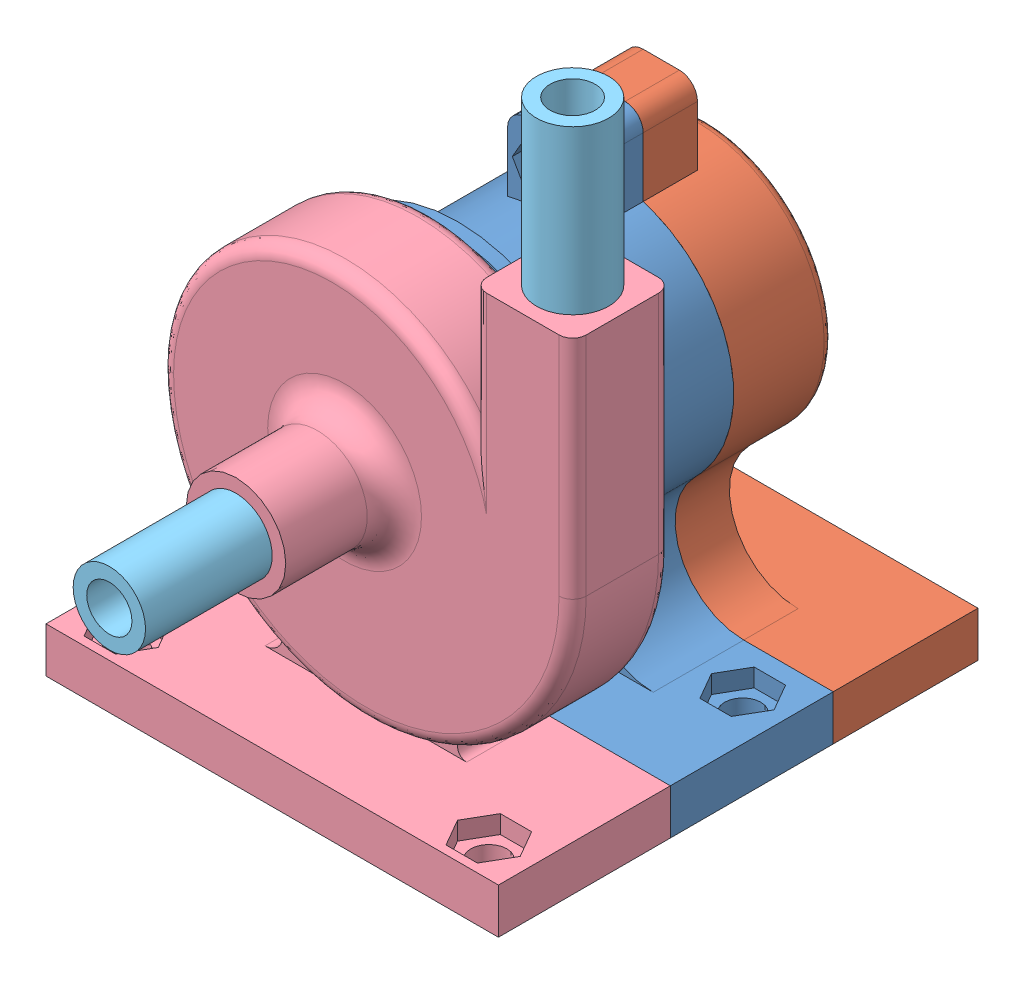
SolidWorks assembly Bomba.SLDASM, configuration Predeterminado (file format 5000). Lengths in mm.
Overall size (50.2 71 71).
6 component instances, 5 part files, 11 mates.
Components (placement in the parent):
- Motor1-1: Motor1.SLDPRT [Predeterminado] at (7.5607 -7.0264 -10) size (50 50 20)
- Motor2-1: Motor2.SLDPRT [Predeterminado] at (7.5607 -7.0264 -21) size (50 50 16)
- Impulsor2-1: Impulsor2.SLDPRT [Predeterminado] at (7.5607 -7.0264 11.5) size (30 30 5.5)
- Carcasa-1: Carcasa.SLDPRT [Predeterminado] at (7.5607 -7.0264 8) size (50.2 53 23)
- Manguera-1: Manguera.SLDPRT [Predeterminado] at (7.5607 -7.0264 22) size (8 8 23)
- Manguera-2: Manguera.SLDPRT [Predeterminado] at (27.2607 12.9736 13.5) x (0.107352 0 0.994221) z (0 1 0) size (8 8 23)
Mates (geometry in assembly coordinates):
- Coincidente1: coincident anti-aligned: plane of Motor1-1 through (7.5607 -7.0264 -10) normal (0 0 -1); plane of Motor2-1 through (-7.5445 -22.443 -10) normal (0 0 1)
- Coincidente2: coincident aligned: plane of Motor1-1 through (7.5607 -35.0264 -10) normal (0 -1 0); plane of Motor2-1 through (-17.4393 -35.0264 -10) normal (0 -1 0)
- Coincidente3: coincident aligned: plane of Motor1-1 through (32.5607 -7.0264 -10) normal (1 0 0); plane of Motor2-1 through (32.5607 -35.0264 -10) normal (1 0 0)
- Concéntrica1: concentric anti-aligned: cylinder of Motor1-1 through (7.5607 -7.0264 -10) axis (0 0 1) radius 3.5; cylinder of Impulsor2-1 through (7.5607 -7.0264 13) axis (0 0 -1) radius 1.5
- Distancia1: distance = 1.5 mm anti-aligned: plane of Motor1-1 through (7.5607 -7.0264 10) normal (0 0 1); plane of Impulsor2-1 through (7.5607 -7.0264 11.5) normal (0 0 -1)
- Concéntrica2: concentric anti-aligned: cylinder of Motor1-1 through (7.5607 -7.0264 8) axis (0 0 1) radius 15.75; cylinder of Carcasa-1 through (7.5607 -7.0264 19.001) axis (0 0 -1) radius 16
- Coincidente4: coincident aligned: circle of Motor1-1; plane of Carcasa-1 through (9.9607 -7.0264 8) normal (0 0 -1)
- Paralelo1: parallel aligned: plane of Motor1-1 through (7.5607 -30.0264 -10) normal (0 1 0); plane of Carcasa-1 through (21.7607 17.9736 19) normal (0 1 0)
- Coincidente5: coincident anti-aligned: circle of Carcasa-1; circle of Manguera-1
- Concéntrica3: concentric anti-aligned: cylinder of Carcasa-1 through (27.2607 5.9736 13.5) axis (0 1 0) radius 4; cylinder of Manguera-2 through (27.2607 35.9736 13.5) axis (0 -1 0) radius 4
- Distancia2: distance = 5 mm anti-aligned: plane of Carcasa-1 through (21.7607 17.9736 19) normal (0 1 0); plane of Manguera-2 through (27.2607 12.9736 13.5) normal (0 -1 0)
